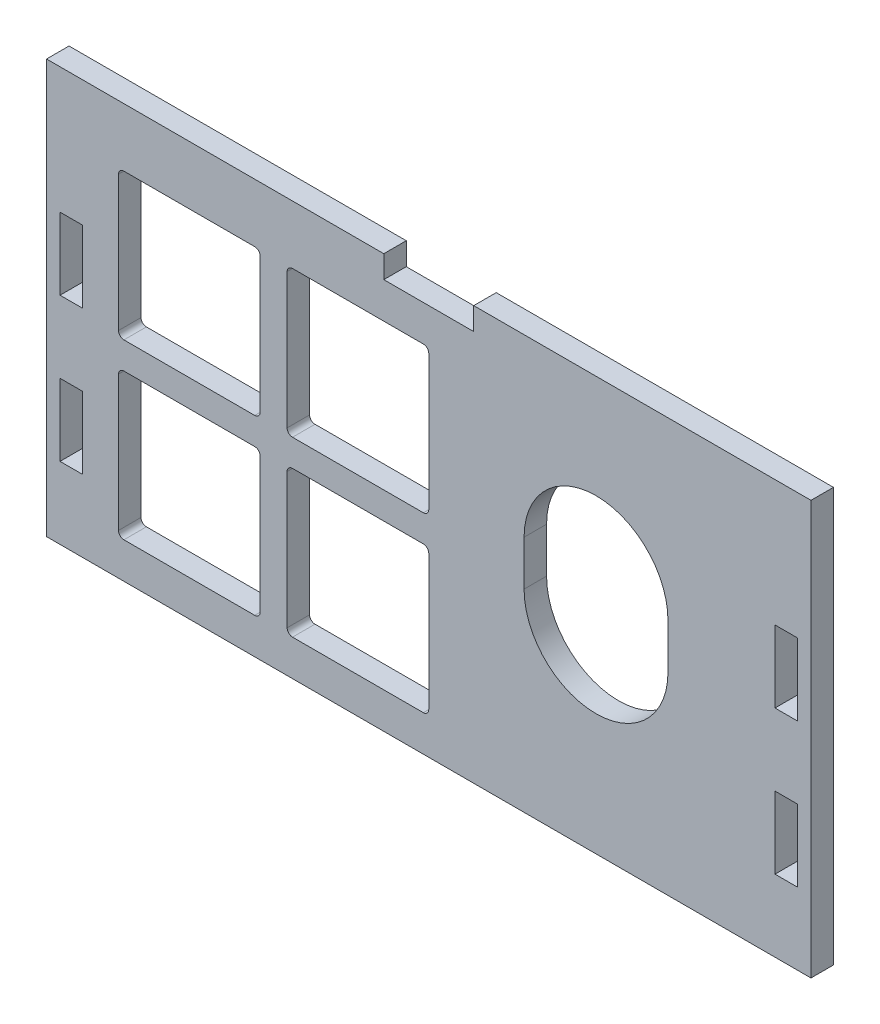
from build123d import *

# Parameters (mm, degrees)
SKETCH_1_W          = 85
SKETCH_1_H          = 46
EXTRUDE_1_DEPTH     = 2.5
SKETCH_2_W          = 2.5
SKETCH_2_H          = 8
CUT_EXTRUDE_1_DEPTH = 2.5
CUT_EXTRUDE_2_DEPTH = 2.5
SKETCH_4_W          = 10
SKETCH_4_H          = 2.5
CUT_EXTRUDE_3_DEPTH = 2.5
CUT_EXTRUDE_4_DEPTH = 2.5


with BuildPart() as part:
    # Sketch 1 → Extrude 1 (new body)
    with BuildSketch(Plane.XY):
        with Locations((0, 23)):
            Rectangle(SKETCH_1_W, SKETCH_1_H)
    extrude(amount=EXTRUDE_1_DEPTH)

    # Sketch 2 → Cut-Extrude 1 (cut)
    with BuildSketch(Plane.XY.offset(2.5)):
        with Locations((39.75, 28)):
            Rectangle(SKETCH_2_W, SKETCH_2_H)
        with Locations((39.75, 12)):
            Rectangle(SKETCH_2_W, SKETCH_2_H)
        with Locations((-39.75, 12)):
            Rectangle(SKETCH_2_W, SKETCH_2_H)
        with Locations((-39.75, 28)):
            Rectangle(SKETCH_2_W, SKETCH_2_H)
    extrude(amount=-CUT_EXTRUDE_1_DEPTH, mode=Mode.SUBTRACT)

    # Sketch 3 → Cut-Extrude 2 (cut)
    with BuildSketch(Plane.XY.offset(2.5)):
        with BuildLine():
            Line((26.6, 26.5), (26.6, 21.5))
            ThreePointArc((26.6, 21.5), (18.6, 13.5), (10.6, 21.5))
            Line((10.6, 21.5), (10.6, 26.5))
            ThreePointArc((10.6, 26.5), (18.6, 34.5), (26.6, 26.5))
        make_face()
    extrude(amount=-CUT_EXTRUDE_2_DEPTH, mode=Mode.SUBTRACT)

    # Sketch 4 → Cut-Extrude 3 (cut)
    with BuildSketch(Plane.XY.offset(2.5)):
        with Locations((0, 44.75)):
            Rectangle(SKETCH_4_W, SKETCH_4_H)
    extrude(amount=-CUT_EXTRUDE_3_DEPTH, mode=Mode.SUBTRACT)

    # Sketch 5 → Cut-Extrude 4 (cut)
    with BuildSketch(Plane.XY.offset(2.5)):
        with BuildLine():
            Line((-18.75, 38.9), (-18.75, 23.85))
            ThreePointArc((-18.75, 23.85), (-18.925735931, 23.425735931), (-19.35, 23.25))
            Line((-19.35, 23.25), (-33.9, 23.25))
            ThreePointArc((-33.9, 23.25), (-34.324264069, 23.425735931), (-34.5, 23.85))
            Line((-34.5, 23.85), (-34.5, 38.9))
            ThreePointArc((-34.5, 38.9), (-34.324264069, 39.324264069), (-33.9, 39.5))
            Line((-33.9, 39.5), (-19.35, 39.5))
            ThreePointArc((-19.35, 39.5), (-18.925735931, 39.324264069), (-18.75, 38.9))
        make_face()
        with BuildLine():
            Line((-33.9, 4), (-19.35, 4))
            ThreePointArc((-19.35, 4), (-18.925735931, 4.175735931), (-18.75, 4.6))
            Line((-18.75, 4.6), (-18.75, 19.65))
            ThreePointArc((-18.75, 19.65), (-18.925735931, 20.074264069), (-19.35, 20.25))
            Line((-19.35, 20.25), (-33.9, 20.25))
            ThreePointArc((-33.9, 20.25), (-34.324264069, 20.074264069), (-34.5, 19.65))
            Line((-34.5, 19.65), (-34.5, 4.6))
            ThreePointArc((-34.5, 4.6), (-34.324264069, 4.175735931), (-33.9, 4))
        make_face()
        with BuildLine():
            Line((-0.6, 39.5), (-15.15, 39.5))
            ThreePointArc((-15.15, 39.5), (-15.574264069, 39.324264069), (-15.75, 38.9))
            Line((-15.75, 38.9), (-15.75, 23.85))
            ThreePointArc((-15.75, 23.85), (-15.574264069, 23.425735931), (-15.15, 23.25))
            Line((-15.15, 23.25), (-0.6, 23.25))
            ThreePointArc((-0.6, 23.25), (-0.175735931, 23.425735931), (0, 23.85))
            Line((0, 23.85), (0, 38.9))
            ThreePointArc((0, 38.9), (-0.175735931, 39.324264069), (-0.6, 39.5))
        make_face()
        with BuildLine():
            Line((-15.75, 4.6), (-15.75, 19.65))
            ThreePointArc((-15.75, 19.65), (-15.574264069, 20.074264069), (-15.15, 20.25))
            Line((-15.15, 20.25), (-0.6, 20.25))
            ThreePointArc((-0.6, 20.25), (-0.175735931, 20.074264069), (0, 19.65))
            Line((0, 19.65), (0, 4.6))
            ThreePointArc((0, 4.6), (-0.175735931, 4.175735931), (-0.6, 4))
            Line((-0.6, 4), (-15.15, 4))
            ThreePointArc((-15.15, 4), (-15.574264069, 4.175735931), (-15.75, 4.6))
        make_face()
    extrude(amount=-CUT_EXTRUDE_4_DEPTH, mode=Mode.SUBTRACT)


solid = part.part
